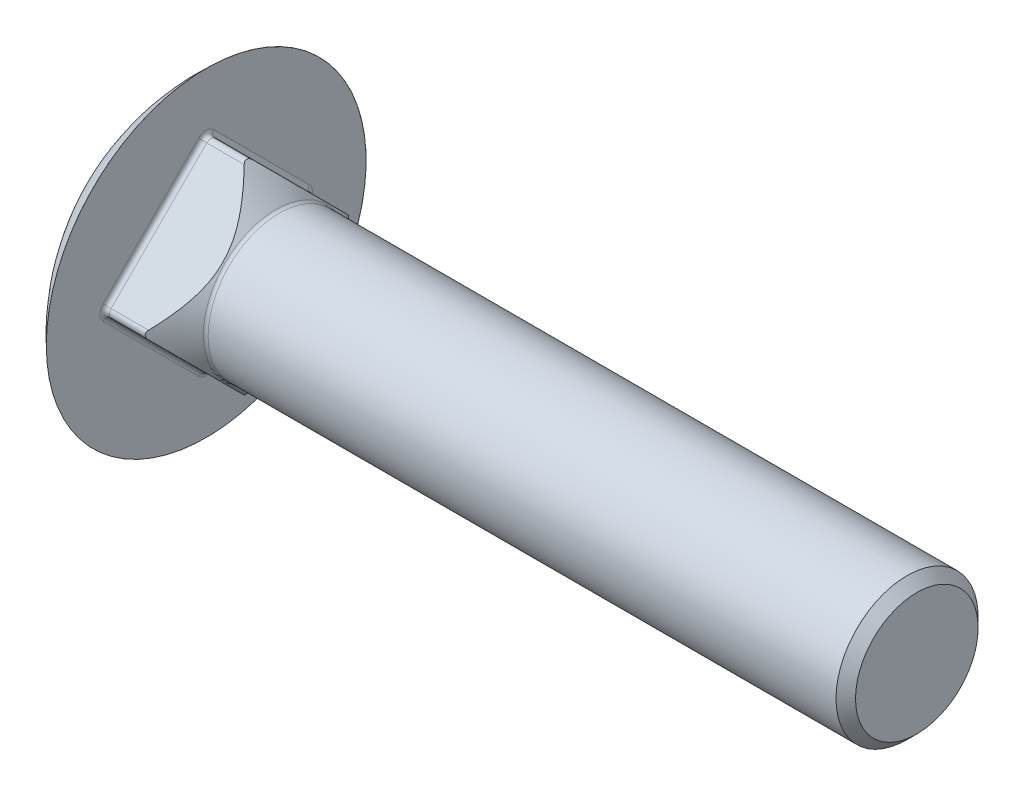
ISO-10303-21;
HEADER;
FILE_DESCRIPTION(('STEP AP214'),'2;1');
FILE_NAME('part.step','',(''),(''),'','','');
FILE_SCHEMA(('AUTOMOTIVE_DESIGN { 1 0 10303 214 1 1 1 1 }'));
ENDSEC;
DATA;
#1=APPLICATION_CONTEXT('core data for automotive mechanical design processes');
#2=APPLICATION_PROTOCOL_DEFINITION('international standard','automotive_design',2000,#1);
#3=PRODUCT_CONTEXT('',#1,'mechanical');
#4=PRODUCT('Part','Part','',(#3));
#5=PRODUCT_RELATED_PRODUCT_CATEGORY('part','',(#4));
#6=PRODUCT_DEFINITION_FORMATION('','',#4);
#7=PRODUCT_DEFINITION_CONTEXT('part definition',#1,'design');
#8=PRODUCT_DEFINITION('design','',#6,#7);
#9=PRODUCT_DEFINITION_SHAPE('','',#8);
#10=(LENGTH_UNIT() NAMED_UNIT(*) SI_UNIT(.MILLI.,.METRE.));
#11=(NAMED_UNIT(*) PLANE_ANGLE_UNIT() SI_UNIT($,.RADIAN.));
#12=(NAMED_UNIT(*) SI_UNIT($,.STERADIAN.) SOLID_ANGLE_UNIT());
#13=UNCERTAINTY_MEASURE_WITH_UNIT(LENGTH_MEASURE(1.E-05),#10,'distance_accuracy_value','');
#14=(GEOMETRIC_REPRESENTATION_CONTEXT(3) GLOBAL_UNCERTAINTY_ASSIGNED_CONTEXT((#13)) GLOBAL_UNIT_ASSIGNED_CONTEXT((#10,
#11,#12)) REPRESENTATION_CONTEXT('',''));
#15=CARTESIAN_POINT('',(0.,0.,0.));
#16=DIRECTION('',(0.,0.,1.));
#17=DIRECTION('',(1.,0.,0.));
#18=AXIS2_PLACEMENT_3D('',#15,#16,#17);
#19=CARTESIAN_POINT('',(24.,17.5645324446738,0.));
#20=DIRECTION('',(0.,-0.707106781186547,-0.707106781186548));
#21=DIRECTION('',(0.,0.707106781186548,-0.707106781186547));
#22=AXIS2_PLACEMENT_3D('',#19,#20,#21);
#23=PLANE('',#22);
#24=DIRECTION('',(-1.,0.,0.));
#25=VECTOR('',#24,1.);
#26=CARTESIAN_POINT('',(24.,16.8574256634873,0.70710678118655));
#27=LINE('',#26,#25);
#28=CARTESIAN_POINT('',(19.127750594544,16.8574256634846,0.707106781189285));
#29=VERTEX_POINT('',#28);
#30=CARTESIAN_POINT('',(12.8,16.8574256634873,0.70710678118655));
#31=VERTEX_POINT('',#30);
#32=EDGE_CURVE('E141',#29,#31,#27,.T.);
#33=ORIENTED_EDGE('',*,*,#32,.T.);
#34=DIRECTION('',(0.,-0.707106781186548,0.707106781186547));
#35=VECTOR('',#34,1.);
#36=CARTESIAN_POINT('',(12.8,0.707106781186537,16.8574256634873));
#37=LINE('',#36,#35);
#38=CARTESIAN_POINT('',(12.8,0.707106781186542,16.8574256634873));
#39=VERTEX_POINT('',#38);
#40=EDGE_CURVE('E59',#31,#39,#37,.T.);
#41=ORIENTED_EDGE('',*,*,#40,.T.);
#42=DIRECTION('',(-1.,0.,0.));
#43=VECTOR('',#42,1.);
#44=CARTESIAN_POINT('',(24.,0.707106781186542,16.8574256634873));
#45=LINE('',#44,#43);
#46=CARTESIAN_POINT('',(19.1277505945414,0.707106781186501,16.8574256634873));
#47=VERTEX_POINT('',#46);
#48=EDGE_CURVE('E142',#39,#47,#45,.F.);
#49=ORIENTED_EDGE('',*,*,#48,.T.);
#50=CARTESIAN_POINT('',(18.4352675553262,17.5647324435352,-0.000199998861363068));
#51=CARTESIAN_POINT('',(18.5579907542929,17.4420075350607,0.122524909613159));
#52=CARTESIAN_POINT('',(18.6798606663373,17.3188564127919,0.24567603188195));
#53=CARTESIAN_POINT('',(18.9217229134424,17.0716299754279,0.492902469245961));
#54=CARTESIAN_POINT('',(19.041715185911,16.9475546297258,0.616977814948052));
#55=CARTESIAN_POINT('',(19.3987064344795,16.5737426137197,0.990789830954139));
#56=CARTESIAN_POINT('',(19.6326168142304,16.322522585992,1.24200985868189));
#57=CARTESIAN_POINT('',(20.0932893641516,15.8123829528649,1.75214949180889));
#58=CARTESIAN_POINT('',(20.3199257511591,15.5534063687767,2.0111260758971));
#59=CARTESIAN_POINT('',(20.760571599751,15.0301514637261,2.53438098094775));
#60=CARTESIAN_POINT('',(20.9745825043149,14.7658737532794,2.79865869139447));
#61=CARTESIAN_POINT('',(21.3934644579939,14.2229122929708,3.34162015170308));
#62=CARTESIAN_POINT('',(21.59784090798,13.9440364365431,3.62049600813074));
#63=CARTESIAN_POINT('',(21.9858925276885,13.3790462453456,4.18548619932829));
#64=CARTESIAN_POINT('',(22.169563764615,13.0929305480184,4.47160189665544));
#65=CARTESIAN_POINT('',(22.5101248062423,12.5144192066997,5.05011323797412));
#66=CARTESIAN_POINT('',(22.6671429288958,12.222061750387,5.34247069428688));
#67=CARTESIAN_POINT('',(22.9493756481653,11.6298585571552,5.93467388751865));
#68=CARTESIAN_POINT('',(23.0746102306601,11.3300176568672,6.23451478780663));
#69=CARTESIAN_POINT('',(23.2812239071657,10.7399650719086,6.82456737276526));
#70=CARTESIAN_POINT('',(23.364608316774,10.4501094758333,7.11442296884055));
#71=CARTESIAN_POINT('',(23.4924442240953,9.8659867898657,7.69854565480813));
#72=CARTESIAN_POINT('',(23.5368872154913,9.57171875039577,7.99281369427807));
#73=CARTESIAN_POINT('',(23.5834640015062,8.98562768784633,8.57890475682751));
#74=CARTESIAN_POINT('',(23.5861826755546,8.69382828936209,8.87070415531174));
#75=CARTESIAN_POINT('',(23.5506242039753,8.11150321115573,9.4530292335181));
#76=CARTESIAN_POINT('',(23.5123468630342,7.82097753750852,9.74355490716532));
#77=CARTESIAN_POINT('',(23.3977453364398,7.24576803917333,10.3187644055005));
#78=CARTESIAN_POINT('',(23.3216785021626,6.96105807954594,10.6034743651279));
#79=CARTESIAN_POINT('',(23.1359867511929,6.39721329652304,11.1673191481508));
#80=CARTESIAN_POINT('',(23.0263574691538,6.11807920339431,11.4464532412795));
#81=CARTESIAN_POINT('',(22.777018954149,5.56268263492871,12.0018498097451));
#82=CARTESIAN_POINT('',(22.6369356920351,5.2865052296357,12.2780272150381));
#83=CARTESIAN_POINT('',(22.3326915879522,4.74093727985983,12.823595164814));
#84=CARTESIAN_POINT('',(22.1685312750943,4.4715465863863,13.0929858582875));
#85=CARTESIAN_POINT('',(21.8713770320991,4.01690047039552,13.5476319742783));
#86=CARTESIAN_POINT('',(21.7432642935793,3.83002969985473,13.7345027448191));
#87=CARTESIAN_POINT('',(21.4785375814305,3.45931205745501,14.1052203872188));
#88=CARTESIAN_POINT('',(21.3419230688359,3.27546537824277,14.2890670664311));
#89=CARTESIAN_POINT('',(21.0612969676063,2.91049544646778,14.654036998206));
#90=CARTESIAN_POINT('',(20.9172813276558,2.72937375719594,14.8351586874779));
#91=CARTESIAN_POINT('',(20.6229123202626,2.36972241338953,15.1948100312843));
#92=CARTESIAN_POINT('',(20.472558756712,2.19119283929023,15.3733396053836));
#93=CARTESIAN_POINT('',(20.1710161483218,1.84189786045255,15.7226345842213));
#94=CARTESIAN_POINT('',(20.0199913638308,1.67106138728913,15.8934710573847));
#95=CARTESIAN_POINT('',(19.7134293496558,1.33142211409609,16.2331103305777));
#96=CARTESIAN_POINT('',(19.5578920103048,1.16261936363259,16.4019130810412));
#97=CARTESIAN_POINT('',(19.2431508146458,0.827171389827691,16.7373610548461));
#98=CARTESIAN_POINT('',(19.0839540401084,0.660522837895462,16.9040096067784));
#99=CARTESIAN_POINT('',(18.7620974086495,0.32892888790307,17.2356035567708));
#100=CARTESIAN_POINT('',(18.5994378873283,0.163983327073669,17.4005491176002));
#101=CARTESIAN_POINT('',(18.4352675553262,-0.000199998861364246,17.5647324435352));
#102=B_SPLINE_CURVE_WITH_KNOTS('',3,(#50,#51,#52,#53,#54,#55,#56,#57,#58,#59,#60,#61,#62,#63,
#64,#65,#66,#67,#68,#69,#70,#71,#72,#73,#74,#75,#76,#77,#78,#79,#80,#81,#82,#83,#84,#85,#86,#87,
#88,#89,#90,#91,#92,#93,#94,#95,#96,#97,#98,#99,#100,#101),.UNSPECIFIED.,.F.,.F.,(4,2,2,2,2,2,2,
2,2,2,2,2,2,2,2,2,2,2,2,2,2,2,2,2,2,4),(0.,0.637689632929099,1.27540047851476,2.55135599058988,
3.8432493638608,5.13499479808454,6.46710633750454,7.79947047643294,9.12522605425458,
10.4501459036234,11.7034194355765,12.9569666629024,14.192925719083,15.4288906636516,
16.6565515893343,17.8843722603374,19.1282230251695,20.3720464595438,21.25296562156,
22.1339406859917,23.0154032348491,23.896893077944,24.7515934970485,25.6063147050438,
26.4595018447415,27.3126066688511),.UNSPECIFIED.);
#103=EDGE_CURVE('E131',#29,#47,#102,.T.);
#104=ORIENTED_EDGE('',*,*,#103,.F.);
#105=EDGE_LOOP('',(#33,#41,#49,#104));
#106=FACE_BOUND('',#105,.T.);
#107=ADVANCED_FACE('F36',(#106),#23,.F.);
#108=CARTESIAN_POINT('',(24.,0.,17.5645324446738));
#109=DIRECTION('',(0.,0.707106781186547,-0.707106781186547));
#110=DIRECTION('',(0.,0.707106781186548,0.707106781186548));
#111=AXIS2_PLACEMENT_3D('',#108,#109,#110);
#112=PLANE('',#111);
#113=DIRECTION('',(-1.,0.,0.));
#114=VECTOR('',#113,1.);
#115=CARTESIAN_POINT('',(24.,-0.707106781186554,16.8574256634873));
#116=LINE('',#115,#114);
#117=CARTESIAN_POINT('',(19.127750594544,-0.707106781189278,16.8574256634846));
#118=VERTEX_POINT('',#117);
#119=CARTESIAN_POINT('',(12.8,-0.707106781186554,16.8574256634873));
#120=VERTEX_POINT('',#119);
#121=EDGE_CURVE('E272',#118,#120,#116,.T.);
#122=ORIENTED_EDGE('',*,*,#121,.T.);
#123=DIRECTION('',(0.,-0.707106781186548,-0.707106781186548));
#124=VECTOR('',#123,1.);
#125=CARTESIAN_POINT('',(12.8,-16.8574256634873,0.707106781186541));
#126=LINE('',#125,#124);
#127=CARTESIAN_POINT('',(12.8,-16.8574256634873,0.707106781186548));
#128=VERTEX_POINT('',#127);
#129=EDGE_CURVE('E306',#120,#128,#126,.T.);
#130=ORIENTED_EDGE('',*,*,#129,.T.);
#131=DIRECTION('',(-1.,0.,0.));
#132=VECTOR('',#131,1.);
#133=CARTESIAN_POINT('',(24.,-16.8574256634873,0.707106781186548));
#134=LINE('',#133,#132);
#135=CARTESIAN_POINT('',(19.1277505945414,-16.8574256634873,0.707106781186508));
#136=VERTEX_POINT('',#135);
#137=EDGE_CURVE('E138',#128,#136,#134,.F.);
#138=ORIENTED_EDGE('',*,*,#137,.T.);
#139=CARTESIAN_POINT('',(18.4352675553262,0.000199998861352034,17.5647324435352));
#140=CARTESIAN_POINT('',(18.5579907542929,-0.122524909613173,17.4420075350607));
#141=CARTESIAN_POINT('',(18.6798606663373,-0.245676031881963,17.3188564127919));
#142=CARTESIAN_POINT('',(18.9217229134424,-0.492902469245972,17.0716299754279));
#143=CARTESIAN_POINT('',(19.041715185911,-0.616977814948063,16.9475546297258));
#144=CARTESIAN_POINT('',(19.3987064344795,-0.990789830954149,16.5737426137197));
#145=CARTESIAN_POINT('',(19.6326168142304,-1.2420098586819,16.3225225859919));
#146=CARTESIAN_POINT('',(20.0932893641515,-1.75214949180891,15.8123829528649));
#147=CARTESIAN_POINT('',(20.3199257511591,-2.01112607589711,15.5534063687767));
#148=CARTESIAN_POINT('',(20.760571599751,-2.53438098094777,15.0301514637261));
#149=CARTESIAN_POINT('',(20.9745825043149,-2.79865869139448,14.7658737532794));
#150=CARTESIAN_POINT('',(21.3934644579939,-3.3416201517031,14.2229122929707));
#151=CARTESIAN_POINT('',(21.59784090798,-3.62049600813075,13.9440364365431));
#152=CARTESIAN_POINT('',(21.9858925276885,-4.1854861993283,13.3790462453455));
#153=CARTESIAN_POINT('',(22.169563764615,-4.47160189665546,13.0929305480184));
#154=CARTESIAN_POINT('',(22.5101248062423,-5.05011323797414,12.5144192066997));
#155=CARTESIAN_POINT('',(22.6671429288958,-5.34247069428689,12.2220617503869));
#156=CARTESIAN_POINT('',(22.9493756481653,-5.93467388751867,11.6298585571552));
#157=CARTESIAN_POINT('',(23.0746102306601,-6.23451478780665,11.3300176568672));
#158=CARTESIAN_POINT('',(23.2812239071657,-6.82456737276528,10.7399650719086));
#159=CARTESIAN_POINT('',(23.364608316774,-7.11442296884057,10.4501094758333));
#160=CARTESIAN_POINT('',(23.4924442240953,-7.69854565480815,9.86598678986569));
#161=CARTESIAN_POINT('',(23.5368872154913,-7.99281369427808,9.57171875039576));
#162=CARTESIAN_POINT('',(23.5834640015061,-8.57890475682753,8.98562768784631));
#163=CARTESIAN_POINT('',(23.5861826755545,-8.87070415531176,8.69382828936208));
#164=CARTESIAN_POINT('',(23.5506242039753,-9.45302923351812,8.11150321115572));
#165=CARTESIAN_POINT('',(23.5123468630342,-9.74355490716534,7.8209775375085));
#166=CARTESIAN_POINT('',(23.3977453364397,-10.3187644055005,7.24576803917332));
#167=CARTESIAN_POINT('',(23.3216785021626,-10.6034743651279,6.96105807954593));
#168=CARTESIAN_POINT('',(23.1359867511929,-11.1673191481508,6.39721329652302));
#169=CARTESIAN_POINT('',(23.0263574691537,-11.4464532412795,6.1180792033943));
#170=CARTESIAN_POINT('',(22.7770189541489,-12.0018498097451,5.5626826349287));
#171=CARTESIAN_POINT('',(22.6369356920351,-12.2780272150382,5.28650522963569));
#172=CARTESIAN_POINT('',(22.3326915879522,-12.823595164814,4.74093727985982));
#173=CARTESIAN_POINT('',(22.1685312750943,-13.0929858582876,4.47154658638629));
#174=CARTESIAN_POINT('',(21.8713770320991,-13.5476319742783,4.01690047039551));
#175=CARTESIAN_POINT('',(21.7432642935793,-13.7345027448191,3.83002969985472));
#176=CARTESIAN_POINT('',(21.4785375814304,-14.1052203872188,3.459312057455));
#177=CARTESIAN_POINT('',(21.3419230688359,-14.2890670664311,3.27546537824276));
#178=CARTESIAN_POINT('',(21.0612969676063,-14.6540369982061,2.91049544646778));
#179=CARTESIAN_POINT('',(20.9172813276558,-14.8351586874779,2.72937375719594));
#180=CARTESIAN_POINT('',(20.6229123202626,-15.1948100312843,2.36972241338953));
#181=CARTESIAN_POINT('',(20.472558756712,-15.3733396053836,2.19119283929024));
#182=CARTESIAN_POINT('',(20.1710161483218,-15.7226345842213,1.84189786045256));
#183=CARTESIAN_POINT('',(20.0199913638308,-15.8934710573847,1.67106138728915));
#184=CARTESIAN_POINT('',(19.7134293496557,-16.2331103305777,1.33142211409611));
#185=CARTESIAN_POINT('',(19.5578920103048,-16.4019130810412,1.16261936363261));
#186=CARTESIAN_POINT('',(19.2431508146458,-16.7373610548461,0.827171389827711));
#187=CARTESIAN_POINT('',(19.0839540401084,-16.9040096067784,0.660522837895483));
#188=CARTESIAN_POINT('',(18.7620974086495,-17.2356035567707,0.328928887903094));
#189=CARTESIAN_POINT('',(18.5994378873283,-17.4005491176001,0.163983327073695));
#190=CARTESIAN_POINT('',(18.4352675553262,-17.5647324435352,-0.000199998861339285));
#191=B_SPLINE_CURVE_WITH_KNOTS('',3,(#139,#140,#141,#142,#143,#144,#145,#146,#147,#148,#149,
#150,#151,#152,#153,#154,#155,#156,#157,#158,#159,#160,#161,#162,#163,#164,#165,#166,#167,#168,
#169,#170,#171,#172,#173,#174,#175,#176,#177,#178,#179,#180,#181,#182,#183,#184,#185,#186,#187,
#188,#189,#190),.UNSPECIFIED.,.F.,.F.,(4,2,2,2,2,2,2,2,2,2,2,2,2,2,2,2,2,2,2,2,2,2,2,2,2,4),(0.,
0.637689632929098,1.27540047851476,2.55135599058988,3.8432493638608,5.13499479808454,
6.46710633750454,7.79947047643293,9.12522605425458,10.4501459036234,11.7034194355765,
12.9569666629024,14.192925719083,15.4288906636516,16.6565515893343,17.8843722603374,
19.1282230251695,20.3720464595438,21.25296562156,22.1339406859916,23.0154032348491,
23.8968930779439,24.7515934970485,25.6063147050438,26.4595018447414,27.312606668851),.UNSPECIFIED.);
#192=EDGE_CURVE('E144',#118,#136,#191,.T.);
#193=ORIENTED_EDGE('',*,*,#192,.F.);
#194=EDGE_LOOP('',(#122,#130,#138,#193));
#195=FACE_BOUND('',#194,.T.);
#196=ADVANCED_FACE('F219',(#195),#112,.F.);
#197=CARTESIAN_POINT('',(24.,-17.5645324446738,0.));
#198=DIRECTION('',(0.,0.707106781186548,0.707106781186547));
#199=DIRECTION('',(0.,-0.707106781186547,0.707106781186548));
#200=AXIS2_PLACEMENT_3D('',#197,#198,#199);
#201=PLANE('',#200);
#202=DIRECTION('',(-1.,0.,0.));
#203=VECTOR('',#202,1.);
#204=CARTESIAN_POINT('',(24.,-16.8574256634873,-0.707106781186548));
#205=LINE('',#204,#203);
#206=CARTESIAN_POINT('',(19.127750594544,-16.8574256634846,-0.707106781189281));
#207=VERTEX_POINT('',#206);
#208=CARTESIAN_POINT('',(12.8,-16.8574256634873,-0.707106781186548));
#209=VERTEX_POINT('',#208);
#210=EDGE_CURVE('E276',#207,#209,#205,.T.);
#211=ORIENTED_EDGE('',*,*,#210,.T.);
#212=DIRECTION('',(0.,0.707106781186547,-0.707106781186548));
#213=VECTOR('',#212,1.);
#214=CARTESIAN_POINT('',(12.8,-0.707106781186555,-16.8574256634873));
#215=LINE('',#214,#213);
#216=CARTESIAN_POINT('',(12.8,-0.707106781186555,-16.8574256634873));
#217=VERTEX_POINT('',#216);
#218=EDGE_CURVE('E304',#209,#217,#215,.T.);
#219=ORIENTED_EDGE('',*,*,#218,.T.);
#220=DIRECTION('',(-1.,0.,0.));
#221=VECTOR('',#220,1.);
#222=CARTESIAN_POINT('',(24.,-0.707106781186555,-16.8574256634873));
#223=LINE('',#222,#221);
#224=CARTESIAN_POINT('',(19.1277505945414,-0.707106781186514,-16.8574256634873));
#225=VERTEX_POINT('',#224);
#226=EDGE_CURVE('E274',#217,#225,#223,.F.);
#227=ORIENTED_EDGE('',*,*,#226,.T.);
#228=CARTESIAN_POINT('',(18.4352675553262,-17.5647324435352,0.00019999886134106));
#229=CARTESIAN_POINT('',(18.5579907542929,-17.4420075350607,-0.122524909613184));
#230=CARTESIAN_POINT('',(18.6798606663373,-17.3188564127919,-0.245676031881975));
#231=CARTESIAN_POINT('',(18.9217229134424,-17.0716299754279,-0.492902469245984));
#232=CARTESIAN_POINT('',(19.041715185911,-16.9475546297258,-0.616977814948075));
#233=CARTESIAN_POINT('',(19.3987064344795,-16.5737426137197,-0.990789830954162));
#234=CARTESIAN_POINT('',(19.6326168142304,-16.3225225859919,-1.24200985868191));
#235=CARTESIAN_POINT('',(20.0932893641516,-15.8123829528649,-1.75214949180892));
#236=CARTESIAN_POINT('',(20.3199257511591,-15.5534063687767,-2.01112607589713));
#237=CARTESIAN_POINT('',(20.760571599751,-15.0301514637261,-2.53438098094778));
#238=CARTESIAN_POINT('',(20.9745825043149,-14.7658737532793,-2.7986586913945));
#239=CARTESIAN_POINT('',(21.3934644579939,-14.2229122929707,-3.34162015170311));
#240=CARTESIAN_POINT('',(21.59784090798,-13.9440364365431,-3.62049600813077));
#241=CARTESIAN_POINT('',(21.9858925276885,-13.3790462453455,-4.18548619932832));
#242=CARTESIAN_POINT('',(22.169563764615,-13.0929305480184,-4.47160189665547));
#243=CARTESIAN_POINT('',(22.5101248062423,-12.5144192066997,-5.05011323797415));
#244=CARTESIAN_POINT('',(22.6671429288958,-12.2220617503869,-5.34247069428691));
#245=CARTESIAN_POINT('',(22.9493756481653,-11.6298585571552,-5.93467388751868));
#246=CARTESIAN_POINT('',(23.0746102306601,-11.3300176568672,-6.23451478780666));
#247=CARTESIAN_POINT('',(23.2812239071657,-10.7399650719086,-6.82456737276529));
#248=CARTESIAN_POINT('',(23.364608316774,-10.4501094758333,-7.11442296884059));
#249=CARTESIAN_POINT('',(23.4924442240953,-9.86598678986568,-7.69854565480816));
#250=CARTESIAN_POINT('',(23.5368872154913,-9.57171875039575,-7.9928136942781));
#251=CARTESIAN_POINT('',(23.5834640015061,-8.9856276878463,-8.57890475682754));
#252=CARTESIAN_POINT('',(23.5861826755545,-8.69382828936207,-8.87070415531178));
#253=CARTESIAN_POINT('',(23.5506242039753,-8.11150321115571,-9.45302923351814));
#254=CARTESIAN_POINT('',(23.5123468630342,-7.82097753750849,-9.74355490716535));
#255=CARTESIAN_POINT('',(23.3977453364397,-7.2457680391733,-10.3187644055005));
#256=CARTESIAN_POINT('',(23.3216785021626,-6.96105807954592,-10.6034743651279));
#257=CARTESIAN_POINT('',(23.1359867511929,-6.39721329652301,-11.1673191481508));
#258=CARTESIAN_POINT('',(23.0263574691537,-6.11807920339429,-11.4464532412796));
#259=CARTESIAN_POINT('',(22.7770189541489,-5.56268263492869,-12.0018498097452));
#260=CARTESIAN_POINT('',(22.6369356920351,-5.28650522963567,-12.2780272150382));
#261=CARTESIAN_POINT('',(22.3326915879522,-4.74093727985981,-12.823595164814));
#262=CARTESIAN_POINT('',(22.1685312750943,-4.47154658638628,-13.0929858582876));
#263=CARTESIAN_POINT('',(21.8713770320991,-4.0169004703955,-13.5476319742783));
#264=CARTESIAN_POINT('',(21.7432642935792,-3.83002969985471,-13.7345027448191));
#265=CARTESIAN_POINT('',(21.4785375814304,-3.459312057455,-14.1052203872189));
#266=CARTESIAN_POINT('',(21.3419230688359,-3.27546537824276,-14.2890670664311));
#267=CARTESIAN_POINT('',(21.0612969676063,-2.91049544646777,-14.6540369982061));
#268=CARTESIAN_POINT('',(20.9172813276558,-2.72937375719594,-14.8351586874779));
#269=CARTESIAN_POINT('',(20.6229123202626,-2.36972241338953,-15.1948100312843));
#270=CARTESIAN_POINT('',(20.472558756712,-2.19119283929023,-15.3733396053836));
#271=CARTESIAN_POINT('',(20.1710161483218,-1.84189786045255,-15.7226345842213));
#272=CARTESIAN_POINT('',(20.0199913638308,-1.67106138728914,-15.8934710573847));
#273=CARTESIAN_POINT('',(19.7134293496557,-1.3314221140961,-16.2331103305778));
#274=CARTESIAN_POINT('',(19.5578920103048,-1.1626193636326,-16.4019130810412));
#275=CARTESIAN_POINT('',(19.2431508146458,-0.827171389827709,-16.7373610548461));
#276=CARTESIAN_POINT('',(19.0839540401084,-0.660522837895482,-16.9040096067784));
#277=CARTESIAN_POINT('',(18.7620974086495,-0.328928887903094,-17.2356035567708));
#278=CARTESIAN_POINT('',(18.5994378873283,-0.163983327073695,-17.4005491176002));
#279=CARTESIAN_POINT('',(18.4352675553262,0.000199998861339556,-17.5647324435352));
#280=B_SPLINE_CURVE_WITH_KNOTS('',3,(#228,#229,#230,#231,#232,#233,#234,#235,#236,#237,#238,
#239,#240,#241,#242,#243,#244,#245,#246,#247,#248,#249,#250,#251,#252,#253,#254,#255,#256,#257,
#258,#259,#260,#261,#262,#263,#264,#265,#266,#267,#268,#269,#270,#271,#272,#273,#274,#275,#276,
#277,#278,#279),.UNSPECIFIED.,.F.,.F.,(4,2,2,2,2,2,2,2,2,2,2,2,2,2,2,2,2,2,2,2,2,2,2,2,2,4),(0.,
0.637689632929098,1.27540047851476,2.55135599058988,3.84324936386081,5.13499479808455,
6.46710633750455,7.79947047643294,9.12522605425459,10.4501459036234,11.7034194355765,
12.9569666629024,14.192925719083,15.4288906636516,16.6565515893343,17.8843722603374,
19.1282230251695,20.3720464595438,21.25296562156,22.1339406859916,23.0154032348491,
23.8968930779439,24.7515934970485,25.6063147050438,26.4595018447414,27.312606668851),.UNSPECIFIED.);
#281=EDGE_CURVE('E357',#207,#225,#280,.T.);
#282=ORIENTED_EDGE('',*,*,#281,.F.);
#283=EDGE_LOOP('',(#211,#219,#227,#282));
#284=FACE_BOUND('',#283,.T.);
#285=ADVANCED_FACE('F224',(#284),#201,.F.);
#286=CARTESIAN_POINT('',(24.,0.,-17.5645324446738));
#287=DIRECTION('',(0.,-0.707106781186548,0.707106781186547));
#288=DIRECTION('',(0.,-0.707106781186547,-0.707106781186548));
#289=AXIS2_PLACEMENT_3D('',#286,#287,#288);
#290=PLANE('',#289);
#291=DIRECTION('',(-1.,0.,0.));
#292=VECTOR('',#291,1.);
#293=CARTESIAN_POINT('',(24.,0.70710678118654,-16.8574256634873));
#294=LINE('',#293,#292);
#295=CARTESIAN_POINT('',(19.127750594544,0.707106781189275,-16.8574256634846));
#296=VERTEX_POINT('',#295);
#297=CARTESIAN_POINT('',(12.8,0.70710678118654,-16.8574256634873));
#298=VERTEX_POINT('',#297);
#299=EDGE_CURVE('E150',#296,#298,#294,.T.);
#300=ORIENTED_EDGE('',*,*,#299,.T.);
#301=DIRECTION('',(0.,0.707106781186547,0.707106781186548));
#302=VECTOR('',#301,1.);
#303=CARTESIAN_POINT('',(12.8,16.8574256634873,-0.707106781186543));
#304=LINE('',#303,#302);
#305=CARTESIAN_POINT('',(12.8,16.8574256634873,-0.707106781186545));
#306=VERTEX_POINT('',#305);
#307=EDGE_CURVE('E302',#298,#306,#304,.T.);
#308=ORIENTED_EDGE('',*,*,#307,.T.);
#309=DIRECTION('',(-1.,0.,0.));
#310=VECTOR('',#309,1.);
#311=CARTESIAN_POINT('',(24.,16.8574256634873,-0.707106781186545));
#312=LINE('',#311,#310);
#313=CARTESIAN_POINT('',(19.1277505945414,16.8574256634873,-0.707106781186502));
#314=VERTEX_POINT('',#313);
#315=EDGE_CURVE('E153',#306,#314,#312,.F.);
#316=ORIENTED_EDGE('',*,*,#315,.T.);
#317=CARTESIAN_POINT('',(18.4352675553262,-0.000199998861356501,-17.5647324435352));
#318=CARTESIAN_POINT('',(18.5579907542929,0.122524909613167,-17.4420075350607));
#319=CARTESIAN_POINT('',(18.6798606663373,0.245676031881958,-17.3188564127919));
#320=CARTESIAN_POINT('',(18.9217229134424,0.492902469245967,-17.0716299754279));
#321=CARTESIAN_POINT('',(19.041715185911,0.616977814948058,-16.9475546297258));
#322=CARTESIAN_POINT('',(19.3987064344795,0.990789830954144,-16.5737426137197));
#323=CARTESIAN_POINT('',(19.6326168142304,1.24200985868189,-16.3225225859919));
#324=CARTESIAN_POINT('',(20.0932893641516,1.7521494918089,-15.8123829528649));
#325=CARTESIAN_POINT('',(20.3199257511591,2.01112607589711,-15.5534063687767));
#326=CARTESIAN_POINT('',(20.760571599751,2.53438098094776,-15.0301514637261));
#327=CARTESIAN_POINT('',(20.9745825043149,2.79865869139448,-14.7658737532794));
#328=CARTESIAN_POINT('',(21.3934644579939,3.34162015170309,-14.2229122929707));
#329=CARTESIAN_POINT('',(21.59784090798,3.62049600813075,-13.9440364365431));
#330=CARTESIAN_POINT('',(21.9858925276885,4.18548619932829,-13.3790462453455));
#331=CARTESIAN_POINT('',(22.169563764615,4.47160189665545,-13.0929305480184));
#332=CARTESIAN_POINT('',(22.5101248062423,5.05011323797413,-12.5144192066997));
#333=CARTESIAN_POINT('',(22.6671429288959,5.34247069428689,-12.2220617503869));
#334=CARTESIAN_POINT('',(22.9493756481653,5.93467388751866,-11.6298585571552));
#335=CARTESIAN_POINT('',(23.0746102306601,6.23451478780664,-11.3300176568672));
#336=CARTESIAN_POINT('',(23.2812239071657,6.82456737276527,-10.7399650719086));
#337=CARTESIAN_POINT('',(23.364608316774,7.11442296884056,-10.4501094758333));
#338=CARTESIAN_POINT('',(23.4924442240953,7.69854565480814,-9.8659867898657));
#339=CARTESIAN_POINT('',(23.5368872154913,7.99281369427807,-9.57171875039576));
#340=CARTESIAN_POINT('',(23.5834640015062,8.57890475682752,-8.98562768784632));
#341=CARTESIAN_POINT('',(23.5861826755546,8.87070415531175,-8.69382828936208));
#342=CARTESIAN_POINT('',(23.5506242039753,9.45302923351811,-8.11150321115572));
#343=CARTESIAN_POINT('',(23.5123468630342,9.74355490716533,-7.82097753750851));
#344=CARTESIAN_POINT('',(23.3977453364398,10.3187644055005,-7.24576803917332));
#345=CARTESIAN_POINT('',(23.3216785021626,10.6034743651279,-6.96105807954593));
#346=CARTESIAN_POINT('',(23.1359867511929,11.1673191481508,-6.39721329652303));
#347=CARTESIAN_POINT('',(23.0263574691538,11.4464532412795,-6.1180792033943));
#348=CARTESIAN_POINT('',(22.777018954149,12.0018498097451,-5.5626826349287));
#349=CARTESIAN_POINT('',(22.6369356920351,12.2780272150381,-5.28650522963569));
#350=CARTESIAN_POINT('',(22.3326915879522,12.823595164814,-4.74093727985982));
#351=CARTESIAN_POINT('',(22.1685312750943,13.0929858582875,-4.47154658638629));
#352=CARTESIAN_POINT('',(21.8713770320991,13.5476319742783,-4.01690047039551));
#353=CARTESIAN_POINT('',(21.7432642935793,13.7345027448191,-3.83002969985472));
#354=CARTESIAN_POINT('',(21.4785375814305,14.1052203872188,-3.459312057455));
#355=CARTESIAN_POINT('',(21.3419230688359,14.2890670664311,-3.27546537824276));
#356=CARTESIAN_POINT('',(21.0612969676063,14.6540369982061,-2.91049544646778));
#357=CARTESIAN_POINT('',(20.9172813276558,14.8351586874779,-2.72937375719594));
#358=CARTESIAN_POINT('',(20.6229123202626,15.1948100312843,-2.36972241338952));
#359=CARTESIAN_POINT('',(20.472558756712,15.3733396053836,-2.19119283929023));
#360=CARTESIAN_POINT('',(20.1710161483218,15.7226345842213,-1.84189786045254));
#361=CARTESIAN_POINT('',(20.0199913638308,15.8934710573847,-1.67106138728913));
#362=CARTESIAN_POINT('',(19.7134293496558,16.2331103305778,-1.33142211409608));
#363=CARTESIAN_POINT('',(19.5578920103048,16.4019130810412,-1.16261936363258));
#364=CARTESIAN_POINT('',(19.2431508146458,16.7373610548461,-0.827171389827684));
#365=CARTESIAN_POINT('',(19.0839540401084,16.9040096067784,-0.660522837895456));
#366=CARTESIAN_POINT('',(18.7620974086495,17.2356035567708,-0.328928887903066));
#367=CARTESIAN_POINT('',(18.5994378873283,17.4005491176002,-0.163983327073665));
#368=CARTESIAN_POINT('',(18.4352675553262,17.5647324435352,0.000199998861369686));
#369=B_SPLINE_CURVE_WITH_KNOTS('',3,(#317,#318,#319,#320,#321,#322,#323,#324,#325,#326,#327,
#328,#329,#330,#331,#332,#333,#334,#335,#336,#337,#338,#339,#340,#341,#342,#343,#344,#345,#346,
#347,#348,#349,#350,#351,#352,#353,#354,#355,#356,#357,#358,#359,#360,#361,#362,#363,#364,#365,
#366,#367,#368),.UNSPECIFIED.,.F.,.F.,(4,2,2,2,2,2,2,2,2,2,2,2,2,2,2,2,2,2,2,2,2,2,2,2,2,4),(0.,
0.637689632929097,1.27540047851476,2.55135599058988,3.8432493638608,5.13499479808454,
6.46710633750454,7.79947047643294,9.12522605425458,10.4501459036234,11.7034194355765,
12.9569666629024,14.192925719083,15.4288906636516,16.6565515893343,17.8843722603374,
19.1282230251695,20.3720464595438,21.25296562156,22.1339406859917,23.0154032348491,
23.896893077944,24.7515934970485,25.6063147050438,26.4595018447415,27.3126066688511),.UNSPECIFIED.);
#370=EDGE_CURVE('E134',#296,#314,#369,.T.);
#371=ORIENTED_EDGE('',*,*,#370,.F.);
#372=EDGE_LOOP('',(#300,#308,#316,#371));
#373=FACE_BOUND('',#372,.T.);
#374=ADVANCED_FACE('F250',(#373),#290,.F.);
#375=CARTESIAN_POINT('',(12.,27.,0.));
#376=DIRECTION('',(-1.,0.,0.));
#377=DIRECTION('',(0.,0.,1.));
#378=AXIS2_PLACEMENT_3D('',#375,#376,#377);
#379=PLANE('',#378);
#380=CARTESIAN_POINT('',(12.,0.,-16.1503188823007));
#381=DIRECTION('',(-1.,0.,0.));
#382=DIRECTION('',(0.,0.,1.));
#383=AXIS2_PLACEMENT_3D('',#380,#381,#382);
#384=CIRCLE('',#383,1.8);
#385=CARTESIAN_POINT('',(12.,1.27279220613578,-17.4231110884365));
#386=VERTEX_POINT('',#385);
#387=CARTESIAN_POINT('',(12.,-1.27279220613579,-17.4231110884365));
#388=VERTEX_POINT('',#387);
#389=EDGE_CURVE('E292',#386,#388,#384,.T.);
#390=ORIENTED_EDGE('',*,*,#389,.T.);
#391=DIRECTION('',(0.,0.707106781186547,-0.707106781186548));
#392=VECTOR('',#391,1.);
#393=CARTESIAN_POINT('',(12.,-17.4231110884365,-1.27279220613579));
#394=LINE('',#393,#392);
#395=CARTESIAN_POINT('',(12.,-17.4231110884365,-1.27279220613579));
#396=VERTEX_POINT('',#395);
#397=EDGE_CURVE('E294',#388,#396,#394,.F.);
#398=ORIENTED_EDGE('',*,*,#397,.T.);
#399=CARTESIAN_POINT('',(12.,-16.1503188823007,0.));
#400=DIRECTION('',(-1.,0.,0.));
#401=DIRECTION('',(0.,0.,1.));
#402=AXIS2_PLACEMENT_3D('',#399,#400,#401);
#403=CIRCLE('',#402,1.8);
#404=CARTESIAN_POINT('',(12.,-17.4231110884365,1.27279220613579));
#405=VERTEX_POINT('',#404);
#406=EDGE_CURVE('E290',#396,#405,#403,.T.);
#407=ORIENTED_EDGE('',*,*,#406,.T.);
#408=DIRECTION('',(0.,-0.707106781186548,-0.707106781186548));
#409=VECTOR('',#408,1.);
#410=CARTESIAN_POINT('',(12.,-1.27279220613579,17.4231110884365));
#411=LINE('',#410,#409);
#412=CARTESIAN_POINT('',(12.,-1.27279220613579,17.4231110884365));
#413=VERTEX_POINT('',#412);
#414=EDGE_CURVE('E286',#405,#413,#411,.F.);
#415=ORIENTED_EDGE('',*,*,#414,.T.);
#416=CARTESIAN_POINT('',(12.,0.,16.1503188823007));
#417=DIRECTION('',(-1.,0.,0.));
#418=DIRECTION('',(0.,0.,1.));
#419=AXIS2_PLACEMENT_3D('',#416,#417,#418);
#420=CIRCLE('',#419,1.8);
#421=CARTESIAN_POINT('',(12.,1.27279220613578,17.4231110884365));
#422=VERTEX_POINT('',#421);
#423=EDGE_CURVE('E281',#413,#422,#420,.T.);
#424=ORIENTED_EDGE('',*,*,#423,.T.);
#425=DIRECTION('',(0.,-0.707106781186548,0.707106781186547));
#426=VECTOR('',#425,1.);
#427=CARTESIAN_POINT('',(12.,17.4231110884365,1.27279220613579));
#428=LINE('',#427,#426);
#429=CARTESIAN_POINT('',(12.,17.4231110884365,1.27279220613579));
#430=VERTEX_POINT('',#429);
#431=EDGE_CURVE('E279',#422,#430,#428,.F.);
#432=ORIENTED_EDGE('',*,*,#431,.T.);
#433=CARTESIAN_POINT('',(12.,16.1503188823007,0.));
#434=DIRECTION('',(-1.,0.,0.));
#435=DIRECTION('',(0.,0.,1.));
#436=AXIS2_PLACEMENT_3D('',#433,#434,#435);
#437=CIRCLE('',#436,1.8);
#438=CARTESIAN_POINT('',(12.,17.4231110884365,-1.27279220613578));
#439=VERTEX_POINT('',#438);
#440=EDGE_CURVE('E283',#430,#439,#437,.T.);
#441=ORIENTED_EDGE('',*,*,#440,.T.);
#442=DIRECTION('',(0.,0.707106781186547,0.707106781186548));
#443=VECTOR('',#442,1.);
#444=CARTESIAN_POINT('',(12.,1.27279220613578,-17.4231110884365));
#445=LINE('',#444,#443);
#446=EDGE_CURVE('E288',#439,#386,#445,.F.);
#447=ORIENTED_EDGE('',*,*,#446,.T.);
#448=EDGE_LOOP('',(#390,#398,#407,#415,#424,#432,#441,#447));
#449=FACE_BOUND('',#448,.T.);
#450=CARTESIAN_POINT('',(12.,0.,0.));
#451=DIRECTION('',(-1.,0.,0.));
#452=DIRECTION('',(0.,0.,1.));
#453=AXIS2_PLACEMENT_3D('',#450,#451,#452);
#454=CIRCLE('',#453,27.);
#455=CARTESIAN_POINT('',(12.,0.,27.));
#456=VERTEX_POINT('',#455);
#457=EDGE_CURVE('E155',#456,#456,#454,.T.);
#458=ORIENTED_EDGE('',*,*,#457,.F.);
#459=EDGE_LOOP('',(#458));
#460=FACE_BOUND('',#459,.T.);
#461=ADVANCED_FACE('F247',(#449,#460),#379,.F.);
#462=CARTESIAN_POINT('',(36.3752031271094,0.,0.));
#463=DIRECTION('',(-1.,0.,0.));
#464=DIRECTION('',(0.,1.,0.));
#465=AXIS2_PLACEMENT_3D('',#462,#463,#464);
#466=SPHERICAL_SURFACE('',#465,36.3752031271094);
#467=CARTESIAN_POINT('',(11.9999,0.,0.));
#468=DIRECTION('',(-1.,0.,0.));
#469=DIRECTION('',(0.,0.,1.));
#470=AXIS2_PLACEMENT_3D('',#467,#468,#469);
#471=CIRCLE('',#470,27.);
#472=CARTESIAN_POINT('',(11.9999,0.,27.));
#473=VERTEX_POINT('',#472);
#474=EDGE_CURVE('E143',#473,#473,#471,.T.);
#475=ORIENTED_EDGE('',*,*,#474,.T.);
#476=EDGE_LOOP('',(#475));
#477=FACE_BOUND('',#476,.T.);
#478=ADVANCED_FACE('F249',(#477),#466,.T.);
#479=CARTESIAN_POINT('',(-9.82817590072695,0.,0.));
#480=DIRECTION('',(-1.,0.,0.));
#481=DIRECTION('',(0.,0.,1.));
#482=AXIS2_PLACEMENT_3D('',#479,#480,#481);
#483=CYLINDRICAL_SURFACE('',#482,27.);
#484=ORIENTED_EDGE('',*,*,#474,.F.);
#485=EDGE_LOOP('',(#484));
#486=FACE_BOUND('',#485,.T.);
#487=ORIENTED_EDGE('',*,*,#457,.T.);
#488=EDGE_LOOP('',(#487));
#489=FACE_BOUND('',#488,.T.);
#490=ADVANCED_FACE('F231',(#486,#489),#483,.T.);
#491=CARTESIAN_POINT('',(18.4354675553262,0.,0.));
#492=DIRECTION('',(-1.,0.,0.));
#493=DIRECTION('',(0.,0.,1.));
#494=AXIS2_PLACEMENT_3D('',#491,#492,#493);
#495=CONICAL_SURFACE('',#494,17.5645324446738,0.785398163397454);
#496=CARTESIAN_POINT('',(23.7656854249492,0.,0.));
#497=DIRECTION('',(1.,0.,0.));
#498=DIRECTION('',(0.,0.,-1.));
#499=AXIS2_PLACEMENT_3D('',#496,#497,#498);
#500=CIRCLE('',#499,12.2343145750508);
#501=CARTESIAN_POINT('',(23.7656854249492,0.,-12.2343145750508));
#502=VERTEX_POINT('',#501);
#503=EDGE_CURVE('E44',#502,#502,#500,.F.);
#504=ORIENTED_EDGE('',*,*,#503,.T.);
#505=EDGE_LOOP('',(#504));
#506=FACE_BOUND('',#505,.T.);
#507=ORIENTED_EDGE('',*,*,#370,.T.);
#508=CARTESIAN_POINT('',(19.1277505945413,16.8574256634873,-0.707106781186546));
#509=CARTESIAN_POINT('',(19.0961665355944,16.890418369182,-0.674135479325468));
#510=CARTESIAN_POINT('',(19.0660500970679,16.9219770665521,-0.637932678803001));
#511=CARTESIAN_POINT('',(19.0098665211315,16.9809856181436,-0.558961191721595));
#512=CARTESIAN_POINT('',(18.9838342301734,17.0084000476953,-0.516141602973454));
#513=CARTESIAN_POINT('',(18.9415973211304,17.0529614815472,-0.432508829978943));
#514=CARTESIAN_POINT('',(18.9244686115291,17.0710670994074,-0.392685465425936));
#515=CARTESIAN_POINT('',(18.8950185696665,17.1022311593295,-0.309555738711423));
#516=CARTESIAN_POINT('',(18.8826825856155,17.1153049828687,-0.266260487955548));
#517=CARTESIAN_POINT('',(18.8634968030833,17.1356507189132,-0.176751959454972));
#518=CARTESIAN_POINT('',(18.8566905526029,17.1428765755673,-0.130518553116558));
#519=CARTESIAN_POINT('',(18.8492883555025,17.1507355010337,-0.0369729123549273));
#520=CARTESIAN_POINT('',(18.8486935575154,17.1513673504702,0.0103395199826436));
#521=CARTESIAN_POINT('',(18.8534678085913,17.1462980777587,0.0987879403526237));
#522=CARTESIAN_POINT('',(18.8581562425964,17.141319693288,0.140006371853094));
#523=CARTESIAN_POINT('',(18.8721086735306,17.1265167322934,0.220728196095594));
#524=CARTESIAN_POINT('',(18.8813706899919,17.1166942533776,0.26023232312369));
#525=CARTESIAN_POINT('',(18.9042137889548,17.0924976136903,0.337615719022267));
#526=CARTESIAN_POINT('',(18.9178944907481,17.0780185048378,0.375432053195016));
#527=CARTESIAN_POINT('',(18.9488608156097,17.0452952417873,0.447885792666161));
#528=CARTESIAN_POINT('',(18.9661533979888,17.0270438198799,0.482516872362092));
#529=CARTESIAN_POINT('',(19.0056890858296,16.9853914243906,0.551778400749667));
#530=CARTESIAN_POINT('',(19.0282644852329,16.9616478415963,0.586008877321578));
#531=CARTESIAN_POINT('',(19.0761390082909,16.9114087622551,0.649911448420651));
#532=CARTESIAN_POINT('',(19.101422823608,16.8849287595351,0.679607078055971));
#533=CARTESIAN_POINT('',(19.127750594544,16.8574256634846,0.707106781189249));
#534=B_SPLINE_CURVE_WITH_KNOTS('',3,(#508,#509,#510,#511,#512,#513,#514,#515,#516,#517,#518,
#519,#520,#521,#522,#523,#524,#525,#526,#527,#528,#529,#530,#531,#532,#533),.UNSPECIFIED.,.F.,
.F.,(4,2,2,2,2,2,2,2,2,2,2,2,4),(0.,0.169229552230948,0.339832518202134,0.480193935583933,
0.620122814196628,0.761143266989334,0.902189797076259,1.02695209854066,1.15166042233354,
1.27940351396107,1.40739504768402,1.54914049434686,1.69012328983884),.UNSPECIFIED.);
#535=EDGE_CURVE('E128',#314,#29,#534,.T.);
#536=ORIENTED_EDGE('',*,*,#535,.T.);
#537=ORIENTED_EDGE('',*,*,#103,.T.);
#538=CARTESIAN_POINT('',(19.1277505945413,0.707106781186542,16.8574256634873));
#539=CARTESIAN_POINT('',(19.0961665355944,0.674135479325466,16.890418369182));
#540=CARTESIAN_POINT('',(19.0660500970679,0.637932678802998,16.9219770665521));
#541=CARTESIAN_POINT('',(19.0098665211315,0.558961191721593,16.9809856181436));
#542=CARTESIAN_POINT('',(18.9838342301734,0.516141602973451,17.0084000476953));
#543=CARTESIAN_POINT('',(18.9415973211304,0.432508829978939,17.0529614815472));
#544=CARTESIAN_POINT('',(18.9244686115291,0.392685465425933,17.0710670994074));
#545=CARTESIAN_POINT('',(18.8950185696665,0.309555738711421,17.1022311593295));
#546=CARTESIAN_POINT('',(18.8826825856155,0.266260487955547,17.1153049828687));
#547=CARTESIAN_POINT('',(18.8634968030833,0.176751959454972,17.1356507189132));
#548=CARTESIAN_POINT('',(18.8566905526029,0.130518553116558,17.1428765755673));
#549=CARTESIAN_POINT('',(18.8492883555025,0.0369729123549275,17.1507355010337));
#550=CARTESIAN_POINT('',(18.8486935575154,-0.0103395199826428,17.1513673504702));
#551=CARTESIAN_POINT('',(18.8534678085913,-0.0987879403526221,17.1462980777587));
#552=CARTESIAN_POINT('',(18.8581562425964,-0.140006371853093,17.141319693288));
#553=CARTESIAN_POINT('',(18.8721086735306,-0.220728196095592,17.1265167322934));
#554=CARTESIAN_POINT('',(18.8813706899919,-0.260232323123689,17.1166942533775));
#555=CARTESIAN_POINT('',(18.9042137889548,-0.337615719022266,17.0924976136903));
#556=CARTESIAN_POINT('',(18.9178944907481,-0.375432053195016,17.0780185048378));
#557=CARTESIAN_POINT('',(18.9488608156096,-0.44788579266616,17.0452952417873));
#558=CARTESIAN_POINT('',(18.9661533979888,-0.48251687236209,17.0270438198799));
#559=CARTESIAN_POINT('',(19.0056890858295,-0.551778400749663,16.9853914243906));
#560=CARTESIAN_POINT('',(19.0282644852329,-0.586008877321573,16.9616478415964));
#561=CARTESIAN_POINT('',(19.0761390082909,-0.649911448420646,16.9114087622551));
#562=CARTESIAN_POINT('',(19.1014228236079,-0.679607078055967,16.8849287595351));
#563=CARTESIAN_POINT('',(19.127750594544,-0.707106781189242,16.8574256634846));
#564=B_SPLINE_CURVE_WITH_KNOTS('',3,(#538,#539,#540,#541,#542,#543,#544,#545,#546,#547,#548,
#549,#550,#551,#552,#553,#554,#555,#556,#557,#558,#559,#560,#561,#562,#563),.UNSPECIFIED.,.F.,
.F.,(4,2,2,2,2,2,2,2,2,2,2,2,4),(0.,0.169229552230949,0.339832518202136,0.480193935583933,
0.620122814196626,0.761143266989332,0.902189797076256,1.02695209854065,1.15166042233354,
1.27940351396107,1.40739504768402,1.54914049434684,1.69012328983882),.UNSPECIFIED.);
#565=EDGE_CURVE('E139',#47,#118,#564,.T.);
#566=ORIENTED_EDGE('',*,*,#565,.T.);
#567=ORIENTED_EDGE('',*,*,#192,.T.);
#568=CARTESIAN_POINT('',(19.1277505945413,-16.8574256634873,0.707106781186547));
#569=CARTESIAN_POINT('',(19.0961665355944,-16.890418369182,0.674135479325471));
#570=CARTESIAN_POINT('',(19.0660500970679,-16.9219770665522,0.637932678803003));
#571=CARTESIAN_POINT('',(19.0098665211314,-16.9809856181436,0.558961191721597));
#572=CARTESIAN_POINT('',(18.9838342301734,-17.0084000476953,0.516141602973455));
#573=CARTESIAN_POINT('',(18.9415973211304,-17.0529614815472,0.432508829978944));
#574=CARTESIAN_POINT('',(18.9244686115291,-17.0710670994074,0.392685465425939));
#575=CARTESIAN_POINT('',(18.8950185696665,-17.1022311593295,0.309555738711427));
#576=CARTESIAN_POINT('',(18.8826825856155,-17.1153049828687,0.266260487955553));
#577=CARTESIAN_POINT('',(18.8634968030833,-17.1356507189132,0.176751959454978));
#578=CARTESIAN_POINT('',(18.8566905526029,-17.1428765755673,0.130518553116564));
#579=CARTESIAN_POINT('',(18.8492883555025,-17.1507355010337,0.0369729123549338));
#580=CARTESIAN_POINT('',(18.8486935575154,-17.1513673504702,-0.0103395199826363));
#581=CARTESIAN_POINT('',(18.8534678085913,-17.1462980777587,-0.0987879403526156));
#582=CARTESIAN_POINT('',(18.8581562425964,-17.141319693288,-0.140006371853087));
#583=CARTESIAN_POINT('',(18.8721086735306,-17.1265167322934,-0.220728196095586));
#584=CARTESIAN_POINT('',(18.8813706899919,-17.1166942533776,-0.260232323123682));
#585=CARTESIAN_POINT('',(18.9042137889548,-17.0924976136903,-0.337615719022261));
#586=CARTESIAN_POINT('',(18.9178944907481,-17.0780185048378,-0.375432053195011));
#587=CARTESIAN_POINT('',(18.9488608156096,-17.0452952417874,-0.447885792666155));
#588=CARTESIAN_POINT('',(18.9661533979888,-17.0270438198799,-0.482516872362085));
#589=CARTESIAN_POINT('',(19.0056890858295,-16.9853914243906,-0.551778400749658));
#590=CARTESIAN_POINT('',(19.0282644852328,-16.9616478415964,-0.58600887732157));
#591=CARTESIAN_POINT('',(19.0761390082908,-16.9114087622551,-0.649911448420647));
#592=CARTESIAN_POINT('',(19.1014228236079,-16.8849287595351,-0.679607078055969));
#593=CARTESIAN_POINT('',(19.127750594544,-16.8574256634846,-0.707106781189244));
#594=B_SPLINE_CURVE_WITH_KNOTS('',3,(#568,#569,#570,#571,#572,#573,#574,#575,#576,#577,#578,
#579,#580,#581,#582,#583,#584,#585,#586,#587,#588,#589,#590,#591,#592,#593),.UNSPECIFIED.,.F.,
.F.,(4,2,2,2,2,2,2,2,2,2,2,2,4),(0.,0.169229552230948,0.339832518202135,0.48019393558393,
0.620122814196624,0.761143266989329,0.902189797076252,1.02695209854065,1.15166042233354,
1.27940351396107,1.40739504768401,1.54914049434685,1.69012328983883),.UNSPECIFIED.);
#595=EDGE_CURVE('E167',#136,#207,#594,.T.);
#596=ORIENTED_EDGE('',*,*,#595,.T.);
#597=ORIENTED_EDGE('',*,*,#281,.T.);
#598=CARTESIAN_POINT('',(19.1277505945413,-0.707106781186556,-16.8574256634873));
#599=CARTESIAN_POINT('',(19.0961665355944,-0.674135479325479,-16.890418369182));
#600=CARTESIAN_POINT('',(19.0660500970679,-0.637932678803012,-16.9219770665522));
#601=CARTESIAN_POINT('',(19.0098665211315,-0.558961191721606,-16.9809856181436));
#602=CARTESIAN_POINT('',(18.9838342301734,-0.516141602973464,-17.0084000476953));
#603=CARTESIAN_POINT('',(18.9415973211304,-0.432508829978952,-17.0529614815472));
#604=CARTESIAN_POINT('',(18.9244686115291,-0.392685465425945,-17.0710670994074));
#605=CARTESIAN_POINT('',(18.8950185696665,-0.309555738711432,-17.1022311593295));
#606=CARTESIAN_POINT('',(18.8826825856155,-0.266260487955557,-17.1153049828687));
#607=CARTESIAN_POINT('',(18.8634968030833,-0.176751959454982,-17.1356507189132));
#608=CARTESIAN_POINT('',(18.8566905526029,-0.130518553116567,-17.1428765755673));
#609=CARTESIAN_POINT('',(18.8492883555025,-0.036972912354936,-17.1507355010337));
#610=CARTESIAN_POINT('',(18.8486935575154,0.0103395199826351,-17.1513673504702));
#611=CARTESIAN_POINT('',(18.8534678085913,0.0987879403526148,-17.1462980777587));
#612=CARTESIAN_POINT('',(18.8581562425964,0.140006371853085,-17.141319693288));
#613=CARTESIAN_POINT('',(18.8721086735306,0.220728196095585,-17.1265167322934));
#614=CARTESIAN_POINT('',(18.8813706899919,0.260232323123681,-17.1166942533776));
#615=CARTESIAN_POINT('',(18.9042137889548,0.337615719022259,-17.0924976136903));
#616=CARTESIAN_POINT('',(18.9178944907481,0.375432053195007,-17.0780185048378));
#617=CARTESIAN_POINT('',(18.9488608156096,0.447885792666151,-17.0452952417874));
#618=CARTESIAN_POINT('',(18.9661533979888,0.482516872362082,-17.0270438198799));
#619=CARTESIAN_POINT('',(19.0056890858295,0.551778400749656,-16.9853914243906));
#620=CARTESIAN_POINT('',(19.0282644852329,0.586008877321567,-16.9616478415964));
#621=CARTESIAN_POINT('',(19.0761390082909,0.649911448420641,-16.9114087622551));
#622=CARTESIAN_POINT('',(19.1014228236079,0.679607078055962,-16.8849287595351));
#623=CARTESIAN_POINT('',(19.127750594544,0.707106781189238,-16.8574256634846));
#624=B_SPLINE_CURVE_WITH_KNOTS('',3,(#598,#599,#600,#601,#602,#603,#604,#605,#606,#607,#608,
#609,#610,#611,#612,#613,#614,#615,#616,#617,#618,#619,#620,#621,#622,#623),.UNSPECIFIED.,.F.,
.F.,(4,2,2,2,2,2,2,2,2,2,2,2,4),(0.,0.169229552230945,0.339832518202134,0.480193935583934,
0.620122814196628,0.761143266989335,0.90218979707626,1.02695209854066,1.15166042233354,
1.27940351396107,1.40739504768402,1.54914049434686,1.69012328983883),.UNSPECIFIED.);
#625=EDGE_CURVE('E160',#225,#296,#624,.T.);
#626=ORIENTED_EDGE('',*,*,#625,.T.);
#627=EDGE_LOOP('',(#507,#536,#537,#566,#567,#596,#597,#626));
#628=FACE_BOUND('',#627,.T.);
#629=ADVANCED_FACE('F130',(#506,#628),#495,.T.);
#630=CARTESIAN_POINT('',(24.,16.1503188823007,0.));
#631=DIRECTION('',(-1.,0.,0.));
#632=DIRECTION('',(0.,0.,1.));
#633=AXIS2_PLACEMENT_3D('',#630,#631,#632);
#634=CYLINDRICAL_SURFACE('',#633,1.);
#635=ORIENTED_EDGE('',*,*,#315,.F.);
#636=CARTESIAN_POINT('',(12.8,16.1503188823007,0.));
#637=DIRECTION('',(-1.,0.,0.));
#638=DIRECTION('',(0.,0.,1.));
#639=AXIS2_PLACEMENT_3D('',#636,#637,#638);
#640=CIRCLE('',#639,1.);
#641=EDGE_CURVE('E149',#306,#31,#640,.F.);
#642=ORIENTED_EDGE('',*,*,#641,.T.);
#643=ORIENTED_EDGE('',*,*,#32,.F.);
#644=ORIENTED_EDGE('',*,*,#535,.F.);
#645=EDGE_LOOP('',(#635,#642,#643,#644));
#646=FACE_BOUND('',#645,.T.);
#647=ADVANCED_FACE('F147',(#646),#634,.T.);
#648=CARTESIAN_POINT('',(24.,0.,16.1503188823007));
#649=DIRECTION('',(-1.,0.,0.));
#650=DIRECTION('',(0.,0.,1.));
#651=AXIS2_PLACEMENT_3D('',#648,#649,#650);
#652=CYLINDRICAL_SURFACE('',#651,1.);
#653=ORIENTED_EDGE('',*,*,#48,.F.);
#654=CARTESIAN_POINT('',(12.8,0.,16.1503188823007));
#655=DIRECTION('',(-1.,0.,0.));
#656=DIRECTION('',(0.,0.,1.));
#657=AXIS2_PLACEMENT_3D('',#654,#655,#656);
#658=CIRCLE('',#657,1.);
#659=EDGE_CURVE('E51',#39,#120,#658,.F.);
#660=ORIENTED_EDGE('',*,*,#659,.T.);
#661=ORIENTED_EDGE('',*,*,#121,.F.);
#662=ORIENTED_EDGE('',*,*,#565,.F.);
#663=EDGE_LOOP('',(#653,#660,#661,#662));
#664=FACE_BOUND('',#663,.T.);
#665=ADVANCED_FACE('F262',(#664),#652,.T.);
#666=CARTESIAN_POINT('',(24.,-16.1503188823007,0.));
#667=DIRECTION('',(-1.,0.,0.));
#668=DIRECTION('',(0.,0.,1.));
#669=AXIS2_PLACEMENT_3D('',#666,#667,#668);
#670=CYLINDRICAL_SURFACE('',#669,1.);
#671=ORIENTED_EDGE('',*,*,#137,.F.);
#672=CARTESIAN_POINT('',(12.8,-16.1503188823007,0.));
#673=DIRECTION('',(-1.,0.,0.));
#674=DIRECTION('',(0.,0.,1.));
#675=AXIS2_PLACEMENT_3D('',#672,#673,#674);
#676=CIRCLE('',#675,1.);
#677=EDGE_CURVE('E299',#128,#209,#676,.F.);
#678=ORIENTED_EDGE('',*,*,#677,.T.);
#679=ORIENTED_EDGE('',*,*,#210,.F.);
#680=ORIENTED_EDGE('',*,*,#595,.F.);
#681=EDGE_LOOP('',(#671,#678,#679,#680));
#682=FACE_BOUND('',#681,.T.);
#683=ADVANCED_FACE('F181',(#682),#670,.T.);
#684=CARTESIAN_POINT('',(24.,0.,-16.1503188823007));
#685=DIRECTION('',(-1.,0.,0.));
#686=DIRECTION('',(0.,0.,1.));
#687=AXIS2_PLACEMENT_3D('',#684,#685,#686);
#688=CYLINDRICAL_SURFACE('',#687,1.);
#689=ORIENTED_EDGE('',*,*,#226,.F.);
#690=CARTESIAN_POINT('',(12.8,0.,-16.1503188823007));
#691=DIRECTION('',(-1.,0.,0.));
#692=DIRECTION('',(0.,0.,1.));
#693=AXIS2_PLACEMENT_3D('',#690,#691,#692);
#694=CIRCLE('',#693,1.);
#695=EDGE_CURVE('E297',#217,#298,#694,.F.);
#696=ORIENTED_EDGE('',*,*,#695,.T.);
#697=ORIENTED_EDGE('',*,*,#299,.F.);
#698=ORIENTED_EDGE('',*,*,#625,.F.);
#699=EDGE_LOOP('',(#689,#696,#697,#698));
#700=FACE_BOUND('',#699,.T.);
#701=ADVANCED_FACE('F176',(#700),#688,.T.);
#702=CARTESIAN_POINT('',(12.8,-16.1503188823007,0.));
#703=DIRECTION('',(-1.,0.,0.));
#704=DIRECTION('',(0.,0.,1.));
#705=AXIS2_PLACEMENT_3D('',#702,#703,#704);
#706=TOROIDAL_SURFACE('',#705,1.8,0.8);
#707=CARTESIAN_POINT('',(12.8,-17.4231110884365,-1.27279220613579));
#708=DIRECTION('',(0.,-0.707106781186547,0.707106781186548));
#709=DIRECTION('',(0.,-0.707106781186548,-0.707106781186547));
#710=AXIS2_PLACEMENT_3D('',#707,#708,#709);
#711=CIRCLE('',#710,0.8);
#712=EDGE_CURVE('E326',#209,#396,#711,.T.);
#713=ORIENTED_EDGE('',*,*,#712,.F.);
#714=ORIENTED_EDGE('',*,*,#677,.F.);
#715=CARTESIAN_POINT('',(12.8,-17.4231110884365,1.27279220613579));
#716=DIRECTION('',(0.,-0.707106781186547,-0.707106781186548));
#717=DIRECTION('',(0.,0.707106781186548,-0.707106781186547));
#718=AXIS2_PLACEMENT_3D('',#715,#716,#717);
#719=CIRCLE('',#718,0.8);
#720=EDGE_CURVE('E329',#405,#128,#719,.T.);
#721=ORIENTED_EDGE('',*,*,#720,.F.);
#722=ORIENTED_EDGE('',*,*,#406,.F.);
#723=EDGE_LOOP('',(#713,#714,#721,#722));
#724=FACE_BOUND('',#723,.T.);
#725=ADVANCED_FACE('F180',(#724),#706,.F.);
#726=CARTESIAN_POINT('',(12.8,-0.565685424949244,18.1302178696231));
#727=DIRECTION('',(0.,0.707106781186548,0.707106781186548));
#728=DIRECTION('',(0.,-0.707106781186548,0.707106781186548));
#729=AXIS2_PLACEMENT_3D('',#726,#727,#728);
#730=CYLINDRICAL_SURFACE('',#729,0.8);
#731=ORIENTED_EDGE('',*,*,#720,.T.);
#732=ORIENTED_EDGE('',*,*,#129,.F.);
#733=CARTESIAN_POINT('',(12.8,-1.27279220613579,17.4231110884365));
#734=DIRECTION('',(0.,-0.707106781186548,-0.707106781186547));
#735=DIRECTION('',(0.,0.707106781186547,-0.707106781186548));
#736=AXIS2_PLACEMENT_3D('',#733,#734,#735);
#737=CIRCLE('',#736,0.8);
#738=EDGE_CURVE('E323',#413,#120,#737,.T.);
#739=ORIENTED_EDGE('',*,*,#738,.F.);
#740=ORIENTED_EDGE('',*,*,#414,.F.);
#741=EDGE_LOOP('',(#731,#732,#739,#740));
#742=FACE_BOUND('',#741,.T.);
#743=ADVANCED_FACE('F209',(#742),#730,.F.);
#744=CARTESIAN_POINT('',(12.8,-18.1302178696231,-0.565685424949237));
#745=DIRECTION('',(0.,-0.707106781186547,0.707106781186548));
#746=DIRECTION('',(0.,-0.707106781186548,-0.707106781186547));
#747=AXIS2_PLACEMENT_3D('',#744,#745,#746);
#748=CYLINDRICAL_SURFACE('',#747,0.8);
#749=ORIENTED_EDGE('',*,*,#712,.T.);
#750=ORIENTED_EDGE('',*,*,#397,.F.);
#751=CARTESIAN_POINT('',(12.8,-1.27279220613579,-17.4231110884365));
#752=DIRECTION('',(0.,-0.707106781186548,0.707106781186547));
#753=DIRECTION('',(0.,-0.707106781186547,-0.707106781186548));
#754=AXIS2_PLACEMENT_3D('',#751,#752,#753);
#755=CIRCLE('',#754,0.8);
#756=EDGE_CURVE('E320',#217,#388,#755,.T.);
#757=ORIENTED_EDGE('',*,*,#756,.F.);
#758=ORIENTED_EDGE('',*,*,#218,.F.);
#759=EDGE_LOOP('',(#749,#750,#757,#758));
#760=FACE_BOUND('',#759,.T.);
#761=ADVANCED_FACE('F205',(#760),#748,.F.);
#762=CARTESIAN_POINT('',(12.8,0.,16.1503188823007));
#763=DIRECTION('',(-1.,0.,0.));
#764=DIRECTION('',(0.,0.,1.));
#765=AXIS2_PLACEMENT_3D('',#762,#763,#764);
#766=TOROIDAL_SURFACE('',#765,1.8,0.8);
#767=ORIENTED_EDGE('',*,*,#738,.T.);
#768=ORIENTED_EDGE('',*,*,#659,.F.);
#769=CARTESIAN_POINT('',(12.8,1.27279220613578,17.4231110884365));
#770=DIRECTION('',(0.,-0.707106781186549,0.707106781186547));
#771=DIRECTION('',(0.,-0.707106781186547,-0.707106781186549));
#772=AXIS2_PLACEMENT_3D('',#769,#770,#771);
#773=CIRCLE('',#772,0.8);
#774=EDGE_CURVE('E317',#422,#39,#773,.T.);
#775=ORIENTED_EDGE('',*,*,#774,.F.);
#776=ORIENTED_EDGE('',*,*,#423,.F.);
#777=EDGE_LOOP('',(#767,#768,#775,#776));
#778=FACE_BOUND('',#777,.T.);
#779=ADVANCED_FACE('F201',(#778),#766,.F.);
#780=CARTESIAN_POINT('',(12.8,0.,-16.1503188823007));
#781=DIRECTION('',(-1.,0.,0.));
#782=DIRECTION('',(0.,0.,1.));
#783=AXIS2_PLACEMENT_3D('',#780,#781,#782);
#784=TOROIDAL_SURFACE('',#783,1.8,0.8);
#785=ORIENTED_EDGE('',*,*,#756,.T.);
#786=ORIENTED_EDGE('',*,*,#389,.F.);
#787=CARTESIAN_POINT('',(12.8,1.27279220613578,-17.4231110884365));
#788=DIRECTION('',(0.,-0.707106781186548,-0.707106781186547));
#789=DIRECTION('',(0.,0.707106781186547,-0.707106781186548));
#790=AXIS2_PLACEMENT_3D('',#787,#788,#789);
#791=CIRCLE('',#790,0.8);
#792=EDGE_CURVE('E314',#298,#386,#791,.T.);
#793=ORIENTED_EDGE('',*,*,#792,.F.);
#794=ORIENTED_EDGE('',*,*,#695,.F.);
#795=EDGE_LOOP('',(#785,#786,#793,#794));
#796=FACE_BOUND('',#795,.T.);
#797=ADVANCED_FACE('F197',(#796),#784,.F.);
#798=CARTESIAN_POINT('',(12.8,18.1302178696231,0.565685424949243));
#799=DIRECTION('',(0.,0.707106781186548,-0.707106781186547));
#800=DIRECTION('',(0.,0.707106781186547,0.707106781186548));
#801=AXIS2_PLACEMENT_3D('',#798,#799,#800);
#802=CYLINDRICAL_SURFACE('',#801,0.8);
#803=ORIENTED_EDGE('',*,*,#774,.T.);
#804=ORIENTED_EDGE('',*,*,#40,.F.);
#805=CARTESIAN_POINT('',(12.8,17.4231110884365,1.27279220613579));
#806=DIRECTION('',(0.,-0.707106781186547,0.707106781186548));
#807=DIRECTION('',(0.,-0.707106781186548,-0.707106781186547));
#808=AXIS2_PLACEMENT_3D('',#805,#806,#807);
#809=CIRCLE('',#808,0.8);
#810=EDGE_CURVE('E311',#430,#31,#809,.T.);
#811=ORIENTED_EDGE('',*,*,#810,.F.);
#812=ORIENTED_EDGE('',*,*,#431,.F.);
#813=EDGE_LOOP('',(#803,#804,#811,#812));
#814=FACE_BOUND('',#813,.T.);
#815=ADVANCED_FACE('F193',(#814),#802,.F.);
#816=CARTESIAN_POINT('',(12.8,0.565685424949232,-18.1302178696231));
#817=DIRECTION('',(0.,-0.707106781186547,-0.707106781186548));
#818=DIRECTION('',(0.,0.707106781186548,-0.707106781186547));
#819=AXIS2_PLACEMENT_3D('',#816,#817,#818);
#820=CYLINDRICAL_SURFACE('',#819,0.8);
#821=ORIENTED_EDGE('',*,*,#792,.T.);
#822=ORIENTED_EDGE('',*,*,#446,.F.);
#823=CARTESIAN_POINT('',(12.8,17.4231110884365,-1.27279220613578));
#824=DIRECTION('',(0.,-0.707106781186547,-0.707106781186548));
#825=DIRECTION('',(0.,0.707106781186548,-0.707106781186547));
#826=AXIS2_PLACEMENT_3D('',#823,#824,#825);
#827=CIRCLE('',#826,0.8);
#828=EDGE_CURVE('E309',#306,#439,#827,.T.);
#829=ORIENTED_EDGE('',*,*,#828,.F.);
#830=ORIENTED_EDGE('',*,*,#307,.F.);
#831=EDGE_LOOP('',(#821,#822,#829,#830));
#832=FACE_BOUND('',#831,.T.);
#833=ADVANCED_FACE('F189',(#832),#820,.F.);
#834=CARTESIAN_POINT('',(12.8,16.1503188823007,0.));
#835=DIRECTION('',(-1.,0.,0.));
#836=DIRECTION('',(0.,0.,1.));
#837=AXIS2_PLACEMENT_3D('',#834,#835,#836);
#838=TOROIDAL_SURFACE('',#837,1.8,0.8);
#839=ORIENTED_EDGE('',*,*,#810,.T.);
#840=ORIENTED_EDGE('',*,*,#641,.F.);
#841=ORIENTED_EDGE('',*,*,#828,.T.);
#842=ORIENTED_EDGE('',*,*,#440,.F.);
#843=EDGE_LOOP('',(#839,#840,#841,#842));
#844=FACE_BOUND('',#843,.T.);
#845=ADVANCED_FACE('F185',(#844),#838,.F.);
#846=CARTESIAN_POINT('',(132.,0.,-10.352));
#847=DIRECTION('',(-1.,0.,0.));
#848=DIRECTION('',(0.,0.,1.));
#849=AXIS2_PLACEMENT_3D('',#846,#847,#848);
#850=PLANE('',#849);
#851=CARTESIAN_POINT('',(132.,0.,0.));
#852=DIRECTION('',(-1.,0.,0.));
#853=DIRECTION('',(0.,0.,1.));
#854=AXIS2_PLACEMENT_3D('',#851,#852,#853);
#855=CIRCLE('',#854,10.352);
#856=CARTESIAN_POINT('',(132.,0.,10.352));
#857=VERTEX_POINT('',#856);
#858=EDGE_CURVE('E312',#857,#857,#855,.T.);
#859=ORIENTED_EDGE('',*,*,#858,.F.);
#860=EDGE_LOOP('',(#859));
#861=FACE_BOUND('',#860,.T.);
#862=ADVANCED_FACE('F188',(#861),#850,.F.);
#863=CARTESIAN_POINT('',(132.,0.,0.));
#864=DIRECTION('',(-1.,0.,0.));
#865=DIRECTION('',(0.,0.,1.));
#866=AXIS2_PLACEMENT_3D('',#863,#864,#865);
#867=CONICAL_SURFACE('',#866,10.352,0.785398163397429);
#868=CARTESIAN_POINT('',(130.352,0.,0.));
#869=DIRECTION('',(-1.,0.,0.));
#870=DIRECTION('',(0.,0.,1.));
#871=AXIS2_PLACEMENT_3D('',#868,#869,#870);
#872=CIRCLE('',#871,12.);
#873=CARTESIAN_POINT('',(130.352,0.,12.));
#874=VERTEX_POINT('',#873);
#875=EDGE_CURVE('E348',#874,#874,#872,.T.);
#876=ORIENTED_EDGE('',*,*,#875,.F.);
#877=EDGE_LOOP('',(#876));
#878=FACE_BOUND('',#877,.T.);
#879=ORIENTED_EDGE('',*,*,#858,.T.);
#880=EDGE_LOOP('',(#879));
#881=FACE_BOUND('',#880,.T.);
#882=ADVANCED_FACE('F341',(#878,#881),#867,.T.);
#883=CARTESIAN_POINT('',(-12.2854470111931,0.,0.));
#884=DIRECTION('',(-1.,0.,0.));
#885=DIRECTION('',(0.,0.,1.));
#886=AXIS2_PLACEMENT_3D('',#883,#884,#885);
#887=CYLINDRICAL_SURFACE('',#886,12.);
#888=CARTESIAN_POINT('',(24.3313708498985,0.,0.));
#889=DIRECTION('',(-1.,0.,0.));
#890=DIRECTION('',(0.,0.,1.));
#891=AXIS2_PLACEMENT_3D('',#888,#889,#890);
#892=CIRCLE('',#891,12.);
#893=CARTESIAN_POINT('',(24.3313708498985,0.,12.));
#894=VERTEX_POINT('',#893);
#895=EDGE_CURVE('E11',#894,#894,#892,.F.);
#896=ORIENTED_EDGE('',*,*,#895,.T.);
#897=EDGE_LOOP('',(#896));
#898=FACE_BOUND('',#897,.T.);
#899=ORIENTED_EDGE('',*,*,#875,.T.);
#900=EDGE_LOOP('',(#899));
#901=FACE_BOUND('',#900,.T.);
#902=ADVANCED_FACE('F336',(#898,#901),#887,.T.);
#903=CARTESIAN_POINT('',(24.3313708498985,0.,0.));
#904=DIRECTION('',(-1.,0.,0.));
#905=DIRECTION('',(0.,0.,1.));
#906=AXIS2_PLACEMENT_3D('',#903,#904,#905);
#907=TOROIDAL_SURFACE('',#906,12.8,0.8);
#908=ORIENTED_EDGE('',*,*,#895,.F.);
#909=EDGE_LOOP('',(#908));
#910=FACE_BOUND('',#909,.T.);
#911=ORIENTED_EDGE('',*,*,#503,.F.);
#912=EDGE_LOOP('',(#911));
#913=FACE_BOUND('',#912,.T.);
#914=ADVANCED_FACE('F38',(#910,#913),#907,.F.);
#915=CLOSED_SHELL('',(#107,#196,#285,#374,#461,#478,#490,#629,#647,#665,#683,#701,#725,#743,
#761,#779,#797,#815,#833,#845,#862,#882,#902,#914));
#916=MANIFOLD_SOLID_BREP('B2',#915);
#917=ADVANCED_BREP_SHAPE_REPRESENTATION('',(#18,#916),#14);
#918=SHAPE_DEFINITION_REPRESENTATION(#9,#917);
ENDSEC;
END-ISO-10303-21;
